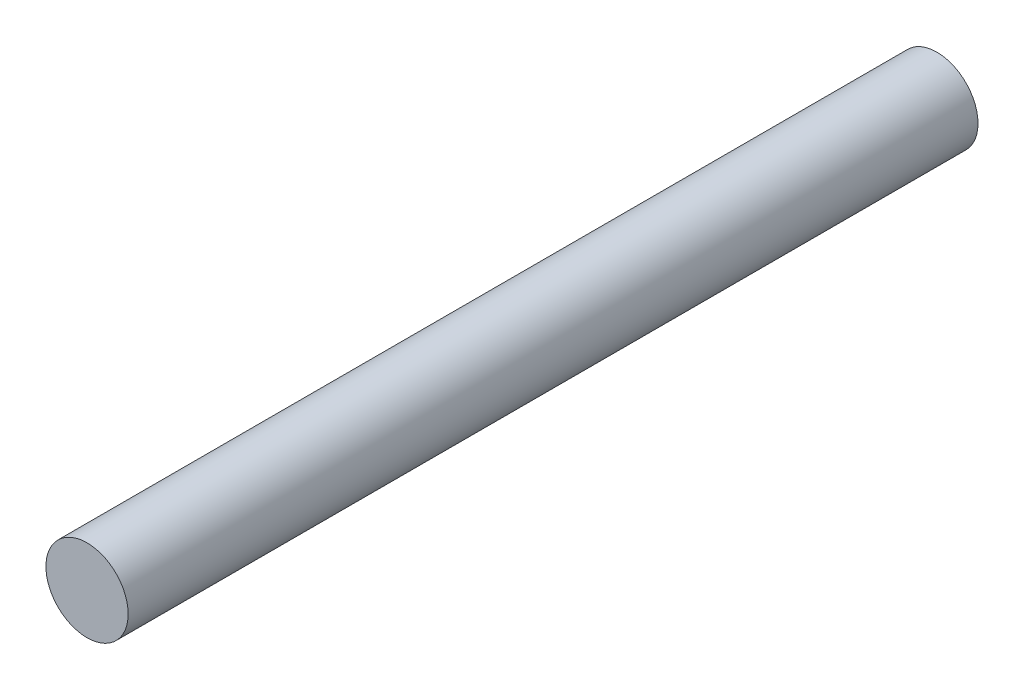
from build123d import *

# Parameters (mm, degrees)
ESQUISSE1_R          = 1.5
BASE_EXTRUSION_DEPTH = 31


with BuildPart() as part:
    # Esquisse1 → Base-Extrusion (new body)
    with BuildSketch(Plane.XY):
        Circle(ESQUISSE1_R)
    extrude(amount=BASE_EXTRUSION_DEPTH)


solid = part.part
